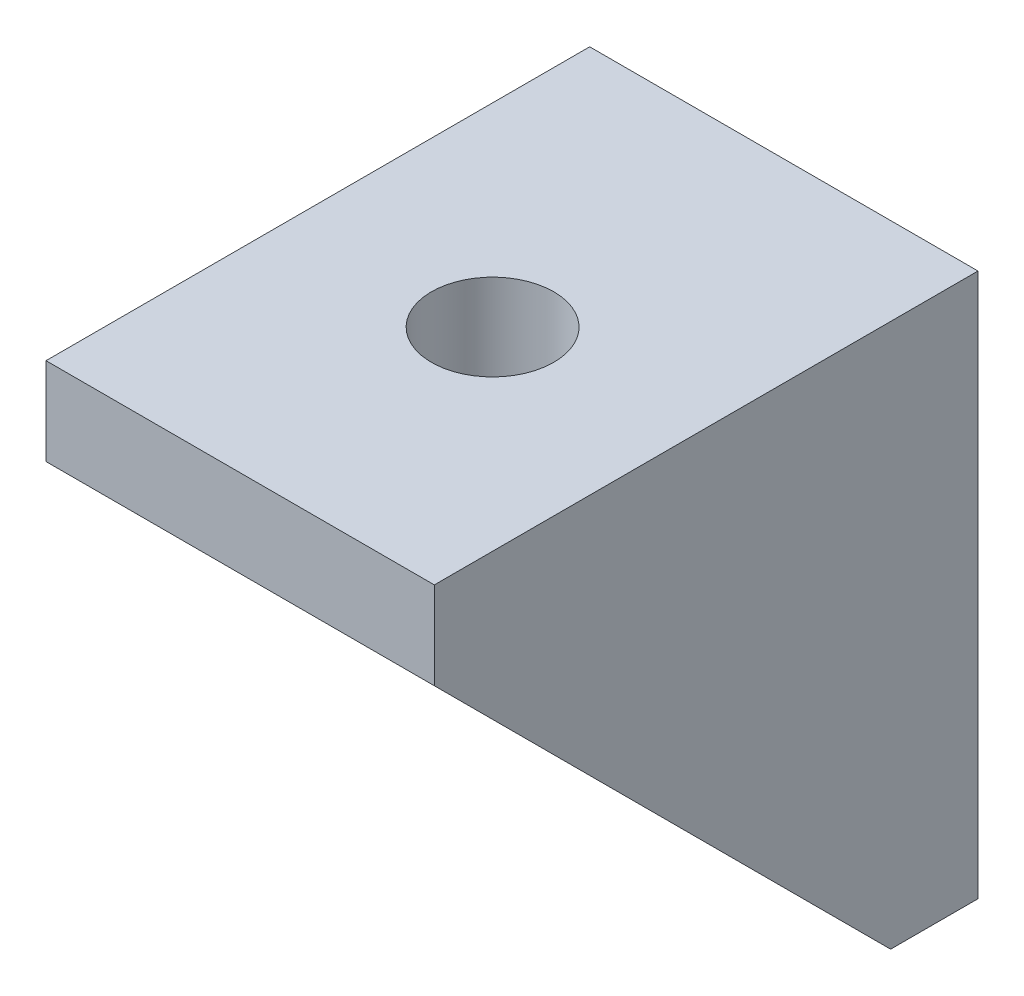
ISO-10303-21;
HEADER;
FILE_DESCRIPTION(('STEP AP214'),'2;1');
FILE_NAME('part.step','',(''),(''),'','','');
FILE_SCHEMA(('AUTOMOTIVE_DESIGN { 1 0 10303 214 1 1 1 1 }'));
ENDSEC;
DATA;
#1=APPLICATION_CONTEXT('core data for automotive mechanical design processes');
#2=APPLICATION_PROTOCOL_DEFINITION('international standard','automotive_design',2000,#1);
#3=PRODUCT_CONTEXT('',#1,'mechanical');
#4=PRODUCT('Part','Part','',(#3));
#5=PRODUCT_RELATED_PRODUCT_CATEGORY('part','',(#4));
#6=PRODUCT_DEFINITION_FORMATION('','',#4);
#7=PRODUCT_DEFINITION_CONTEXT('part definition',#1,'design');
#8=PRODUCT_DEFINITION('design','',#6,#7);
#9=PRODUCT_DEFINITION_SHAPE('','',#8);
#10=(LENGTH_UNIT() NAMED_UNIT(*) SI_UNIT(.MILLI.,.METRE.));
#11=(NAMED_UNIT(*) PLANE_ANGLE_UNIT() SI_UNIT($,.RADIAN.));
#12=(NAMED_UNIT(*) SI_UNIT($,.STERADIAN.) SOLID_ANGLE_UNIT());
#13=UNCERTAINTY_MEASURE_WITH_UNIT(LENGTH_MEASURE(1.E-05),#10,'distance_accuracy_value','');
#14=(GEOMETRIC_REPRESENTATION_CONTEXT(3) GLOBAL_UNCERTAINTY_ASSIGNED_CONTEXT((#13)) GLOBAL_UNIT_ASSIGNED_CONTEXT((#10,
#11,#12)) REPRESENTATION_CONTEXT('',''));
#15=CARTESIAN_POINT('',(0.,0.,0.));
#16=DIRECTION('',(0.,0.,1.));
#17=DIRECTION('',(1.,0.,0.));
#18=AXIS2_PLACEMENT_3D('',#15,#16,#17);
#19=CARTESIAN_POINT('',(8.,-18.5,18.5));
#20=DIRECTION('',(-1.,0.,0.));
#21=DIRECTION('',(0.,0.,1.));
#22=AXIS2_PLACEMENT_3D('',#19,#20,#21);
#23=PLANE('',#22);
#24=DIRECTION('',(0.,0.,-1.));
#25=VECTOR('',#24,1.);
#26=CARTESIAN_POINT('',(8.,-4.5,18.5));
#27=LINE('',#26,#25);
#28=CARTESIAN_POINT('',(8.,-4.5,4.5));
#29=VERTEX_POINT('',#28);
#30=CARTESIAN_POINT('',(8.,-4.5,28.));
#31=VERTEX_POINT('',#30);
#32=EDGE_CURVE('E105',#29,#31,#27,.F.);
#33=ORIENTED_EDGE('',*,*,#32,.F.);
#34=DIRECTION('',(0.,1.,0.));
#35=VECTOR('',#34,1.);
#36=CARTESIAN_POINT('',(8.,-18.5,4.5));
#37=LINE('',#36,#35);
#38=CARTESIAN_POINT('',(8.,-28.,4.5));
#39=VERTEX_POINT('',#38);
#40=EDGE_CURVE('E78',#29,#39,#37,.F.);
#41=ORIENTED_EDGE('',*,*,#40,.T.);
#42=DIRECTION('',(0.,-0.707106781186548,-0.707106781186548));
#43=VECTOR('',#42,1.);
#44=CARTESIAN_POINT('',(8.,-8.20101012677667,24.2989898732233));
#45=LINE('',#44,#43);
#46=EDGE_CURVE('E101',#31,#39,#45,.T.);
#47=ORIENTED_EDGE('',*,*,#46,.F.);
#48=EDGE_LOOP('',(#33,#41,#47));
#49=FACE_BOUND('',#48,.T.);
#50=ADVANCED_FACE('F15',(#49),#23,.T.);
#51=CARTESIAN_POINT('',(0.,-18.5,4.5));
#52=DIRECTION('',(0.,0.,-1.));
#53=DIRECTION('',(-1.,0.,0.));
#54=AXIS2_PLACEMENT_3D('',#51,#52,#53);
#55=PLANE('',#54);
#56=ORIENTED_EDGE('',*,*,#40,.F.);
#57=DIRECTION('',(1.,0.,0.));
#58=VECTOR('',#57,1.);
#59=CARTESIAN_POINT('',(0.,-4.5,4.5));
#60=LINE('',#59,#58);
#61=CARTESIAN_POINT('',(-8.,-4.5,4.5));
#62=VERTEX_POINT('',#61);
#63=EDGE_CURVE('E97',#62,#29,#60,.T.);
#64=ORIENTED_EDGE('',*,*,#63,.F.);
#65=DIRECTION('',(0.,1.,0.));
#66=VECTOR('',#65,1.);
#67=CARTESIAN_POINT('',(-8.,-18.5,4.5));
#68=LINE('',#67,#66);
#69=CARTESIAN_POINT('',(-8.,-28.,4.5));
#70=VERTEX_POINT('',#69);
#71=EDGE_CURVE('E85',#70,#62,#68,.T.);
#72=ORIENTED_EDGE('',*,*,#71,.F.);
#73=DIRECTION('',(1.,0.,0.));
#74=VECTOR('',#73,1.);
#75=CARTESIAN_POINT('',(0.,-28.,4.5));
#76=LINE('',#75,#74);
#77=EDGE_CURVE('E107',#70,#39,#76,.T.);
#78=ORIENTED_EDGE('',*,*,#77,.T.);
#79=EDGE_LOOP('',(#56,#64,#72,#78));
#80=FACE_BOUND('',#79,.T.);
#81=CARTESIAN_POINT('',(0.,-15.,4.5));
#82=DIRECTION('',(0.,0.,1.));
#83=DIRECTION('',(1.,0.,0.));
#84=AXIS2_PLACEMENT_3D('',#81,#82,#83);
#85=CIRCLE('',#84,3.15);
#86=CARTESIAN_POINT('',(3.15,-15.,4.5));
#87=VERTEX_POINT('',#86);
#88=EDGE_CURVE('E18',#87,#87,#85,.F.);
#89=ORIENTED_EDGE('',*,*,#88,.T.);
#90=EDGE_LOOP('',(#89));
#91=FACE_BOUND('',#90,.T.);
#92=ADVANCED_FACE('F103',(#80,#91),#55,.F.);
#93=CARTESIAN_POINT('',(-8.,-18.5,18.5));
#94=DIRECTION('',(1.,0.,0.));
#95=DIRECTION('',(0.,0.,-1.));
#96=AXIS2_PLACEMENT_3D('',#93,#94,#95);
#97=PLANE('',#96);
#98=ORIENTED_EDGE('',*,*,#71,.T.);
#99=DIRECTION('',(0.,0.,-1.));
#100=VECTOR('',#99,1.);
#101=CARTESIAN_POINT('',(-8.,-4.5,18.5));
#102=LINE('',#101,#100);
#103=CARTESIAN_POINT('',(-8.,-4.5,28.));
#104=VERTEX_POINT('',#103);
#105=EDGE_CURVE('E88',#104,#62,#102,.T.);
#106=ORIENTED_EDGE('',*,*,#105,.F.);
#107=DIRECTION('',(0.,-0.707106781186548,-0.707106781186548));
#108=VECTOR('',#107,1.);
#109=CARTESIAN_POINT('',(-8.,-8.20101012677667,24.2989898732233));
#110=LINE('',#109,#108);
#111=EDGE_CURVE('E90',#70,#104,#110,.F.);
#112=ORIENTED_EDGE('',*,*,#111,.F.);
#113=EDGE_LOOP('',(#98,#106,#112));
#114=FACE_BOUND('',#113,.T.);
#115=ADVANCED_FACE('F87',(#114),#97,.T.);
#116=CARTESIAN_POINT('',(0.,-15.,2.25));
#117=DIRECTION('',(0.,0.,1.));
#118=DIRECTION('',(1.,0.,0.));
#119=AXIS2_PLACEMENT_3D('',#116,#117,#118);
#120=CYLINDRICAL_SURFACE('',#119,3.15);
#121=CARTESIAN_POINT('',(0.,-15.,0.));
#122=DIRECTION('',(0.,0.,1.));
#123=DIRECTION('',(1.,0.,0.));
#124=AXIS2_PLACEMENT_3D('',#121,#122,#123);
#125=CIRCLE('',#124,3.15);
#126=CARTESIAN_POINT('',(3.15,-15.,0.));
#127=VERTEX_POINT('',#126);
#128=EDGE_CURVE('E118',#127,#127,#125,.T.);
#129=ORIENTED_EDGE('',*,*,#128,.F.);
#130=EDGE_LOOP('',(#129));
#131=FACE_BOUND('',#130,.T.);
#132=ORIENTED_EDGE('',*,*,#88,.F.);
#133=EDGE_LOOP('',(#132));
#134=FACE_BOUND('',#133,.T.);
#135=ADVANCED_FACE('F212',(#131,#134),#120,.F.);
#136=CARTESIAN_POINT('',(0.,-8.20101012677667,24.2989898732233));
#137=DIRECTION('',(0.,-0.707106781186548,0.707106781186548));
#138=DIRECTION('',(0.,-0.707106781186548,-0.707106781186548));
#139=AXIS2_PLACEMENT_3D('',#136,#137,#138);
#140=PLANE('',#139);
#141=DIRECTION('',(0.,0.707106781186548,0.707106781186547));
#142=VECTOR('',#141,1.);
#143=CARTESIAN_POINT('',(10.,-28.,4.5));
#144=LINE('',#143,#142);
#145=CARTESIAN_POINT('',(10.,-28.,4.5));
#146=VERTEX_POINT('',#145);
#147=CARTESIAN_POINT('',(10.,-4.49999999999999,28.));
#148=VERTEX_POINT('',#147);
#149=EDGE_CURVE('E145',#146,#148,#144,.T.);
#150=ORIENTED_EDGE('',*,*,#149,.T.);
#151=DIRECTION('',(-1.,0.,0.));
#152=VECTOR('',#151,1.);
#153=CARTESIAN_POINT('',(0.,-4.49999999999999,28.));
#154=LINE('',#153,#152);
#155=EDGE_CURVE('E155',#148,#31,#154,.T.);
#156=ORIENTED_EDGE('',*,*,#155,.T.);
#157=ORIENTED_EDGE('',*,*,#46,.T.);
#158=DIRECTION('',(1.,0.,0.));
#159=VECTOR('',#158,1.);
#160=CARTESIAN_POINT('',(0.,-28.,4.5));
#161=LINE('',#160,#159);
#162=EDGE_CURVE('E129',#39,#146,#161,.T.);
#163=ORIENTED_EDGE('',*,*,#162,.T.);
#164=EDGE_LOOP('',(#150,#156,#157,#163));
#165=FACE_BOUND('',#164,.T.);
#166=ADVANCED_FACE('F143',(#165),#140,.T.);
#167=CARTESIAN_POINT('',(0.,-4.5,18.5));
#168=DIRECTION('',(0.,-1.,0.));
#169=DIRECTION('',(0.,0.,-1.));
#170=AXIS2_PLACEMENT_3D('',#167,#168,#169);
#171=PLANE('',#170);
#172=ORIENTED_EDGE('',*,*,#63,.T.);
#173=ORIENTED_EDGE('',*,*,#32,.T.);
#174=DIRECTION('',(-1.,0.,0.));
#175=VECTOR('',#174,1.);
#176=CARTESIAN_POINT('',(0.,-4.5,28.));
#177=LINE('',#176,#175);
#178=EDGE_CURVE('E100',#31,#104,#177,.T.);
#179=ORIENTED_EDGE('',*,*,#178,.T.);
#180=ORIENTED_EDGE('',*,*,#105,.T.);
#181=EDGE_LOOP('',(#172,#173,#179,#180));
#182=FACE_BOUND('',#181,.T.);
#183=CARTESIAN_POINT('',(0.,-4.5,15.));
#184=DIRECTION('',(0.,-1.,0.));
#185=DIRECTION('',(0.,0.,-1.));
#186=AXIS2_PLACEMENT_3D('',#183,#184,#185);
#187=CIRCLE('',#186,3.15);
#188=CARTESIAN_POINT('',(0.,-4.5,11.85));
#189=VERTEX_POINT('',#188);
#190=EDGE_CURVE('E121',#189,#189,#187,.F.);
#191=ORIENTED_EDGE('',*,*,#190,.T.);
#192=EDGE_LOOP('',(#191));
#193=FACE_BOUND('',#192,.T.);
#194=ADVANCED_FACE('F95',(#182,#193),#171,.T.);
#195=CARTESIAN_POINT('',(0.,-28.,14.));
#196=DIRECTION('',(0.,1.,0.));
#197=DIRECTION('',(0.,0.,1.));
#198=AXIS2_PLACEMENT_3D('',#195,#196,#197);
#199=PLANE('',#198);
#200=ORIENTED_EDGE('',*,*,#77,.F.);
#201=DIRECTION('',(1.,0.,0.));
#202=VECTOR('',#201,1.);
#203=CARTESIAN_POINT('',(0.,-28.,4.49999999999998));
#204=LINE('',#203,#202);
#205=CARTESIAN_POINT('',(-10.,-28.,4.5));
#206=VERTEX_POINT('',#205);
#207=EDGE_CURVE('E123',#206,#70,#204,.T.);
#208=ORIENTED_EDGE('',*,*,#207,.F.);
#209=DIRECTION('',(0.,0.,-1.));
#210=VECTOR('',#209,1.);
#211=CARTESIAN_POINT('',(-10.,-28.,14.));
#212=LINE('',#211,#210);
#213=CARTESIAN_POINT('',(-10.,-28.,0.));
#214=VERTEX_POINT('',#213);
#215=EDGE_CURVE('E168',#206,#214,#212,.T.);
#216=ORIENTED_EDGE('',*,*,#215,.T.);
#217=DIRECTION('',(-1.,0.,0.));
#218=VECTOR('',#217,1.);
#219=CARTESIAN_POINT('',(0.,-28.,0.));
#220=LINE('',#219,#218);
#221=CARTESIAN_POINT('',(10.,-28.,0.));
#222=VERTEX_POINT('',#221);
#223=EDGE_CURVE('E120',#222,#214,#220,.T.);
#224=ORIENTED_EDGE('',*,*,#223,.F.);
#225=DIRECTION('',(0.,0.,1.));
#226=VECTOR('',#225,1.);
#227=CARTESIAN_POINT('',(10.,-28.,14.));
#228=LINE('',#227,#226);
#229=EDGE_CURVE('E140',#222,#146,#228,.T.);
#230=ORIENTED_EDGE('',*,*,#229,.T.);
#231=ORIENTED_EDGE('',*,*,#162,.F.);
#232=EDGE_LOOP('',(#200,#208,#216,#224,#230,#231));
#233=FACE_BOUND('',#232,.T.);
#234=ADVANCED_FACE('F136',(#233),#199,.F.);
#235=CARTESIAN_POINT('',(0.,-8.20101012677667,24.2989898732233));
#236=DIRECTION('',(0.,-0.707106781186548,0.707106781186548));
#237=DIRECTION('',(0.,-0.707106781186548,-0.707106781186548));
#238=AXIS2_PLACEMENT_3D('',#235,#236,#237);
#239=PLANE('',#238);
#240=DIRECTION('',(0.,-0.707106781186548,-0.707106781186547));
#241=VECTOR('',#240,1.);
#242=CARTESIAN_POINT('',(-10.,-4.49999999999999,28.));
#243=LINE('',#242,#241);
#244=CARTESIAN_POINT('',(-10.,-4.49999999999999,28.));
#245=VERTEX_POINT('',#244);
#246=EDGE_CURVE('E117',#245,#206,#243,.T.);
#247=ORIENTED_EDGE('',*,*,#246,.T.);
#248=ORIENTED_EDGE('',*,*,#207,.T.);
#249=ORIENTED_EDGE('',*,*,#111,.T.);
#250=DIRECTION('',(-1.,0.,0.));
#251=VECTOR('',#250,1.);
#252=CARTESIAN_POINT('',(0.,-4.5,28.));
#253=LINE('',#252,#251);
#254=EDGE_CURVE('E170',#104,#245,#253,.T.);
#255=ORIENTED_EDGE('',*,*,#254,.T.);
#256=EDGE_LOOP('',(#247,#248,#249,#255));
#257=FACE_BOUND('',#256,.T.);
#258=ADVANCED_FACE('F179',(#257),#239,.T.);
#259=CARTESIAN_POINT('',(0.,-2.25,15.));
#260=DIRECTION('',(0.,-1.,0.));
#261=DIRECTION('',(0.,0.,-1.));
#262=AXIS2_PLACEMENT_3D('',#259,#260,#261);
#263=CYLINDRICAL_SURFACE('',#262,3.15);
#264=ORIENTED_EDGE('',*,*,#190,.F.);
#265=EDGE_LOOP('',(#264));
#266=FACE_BOUND('',#265,.T.);
#267=CARTESIAN_POINT('',(0.,0.,15.));
#268=DIRECTION('',(0.,-1.,0.));
#269=DIRECTION('',(0.,0.,-1.));
#270=AXIS2_PLACEMENT_3D('',#267,#268,#269);
#271=CIRCLE('',#270,3.15);
#272=CARTESIAN_POINT('',(0.,0.,11.85));
#273=VERTEX_POINT('',#272);
#274=EDGE_CURVE('E113',#273,#273,#271,.F.);
#275=ORIENTED_EDGE('',*,*,#274,.T.);
#276=EDGE_LOOP('',(#275));
#277=FACE_BOUND('',#276,.T.);
#278=ADVANCED_FACE('F193',(#266,#277),#263,.F.);
#279=CARTESIAN_POINT('',(0.,-14.,0.));
#280=DIRECTION('',(0.,0.,-1.));
#281=DIRECTION('',(-1.,0.,0.));
#282=AXIS2_PLACEMENT_3D('',#279,#280,#281);
#283=PLANE('',#282);
#284=DIRECTION('',(1.,0.,0.));
#285=VECTOR('',#284,1.);
#286=CARTESIAN_POINT('',(0.,0.,0.));
#287=LINE('',#286,#285);
#288=CARTESIAN_POINT('',(-10.,0.,0.));
#289=VERTEX_POINT('',#288);
#290=CARTESIAN_POINT('',(10.,0.,0.));
#291=VERTEX_POINT('',#290);
#292=EDGE_CURVE('E116',#289,#291,#287,.T.);
#293=ORIENTED_EDGE('',*,*,#292,.T.);
#294=DIRECTION('',(0.,1.,0.));
#295=VECTOR('',#294,1.);
#296=CARTESIAN_POINT('',(10.,-14.,0.));
#297=LINE('',#296,#295);
#298=EDGE_CURVE('E157',#291,#222,#297,.F.);
#299=ORIENTED_EDGE('',*,*,#298,.T.);
#300=ORIENTED_EDGE('',*,*,#223,.T.);
#301=DIRECTION('',(0.,1.,0.));
#302=VECTOR('',#301,1.);
#303=CARTESIAN_POINT('',(-10.,-14.,0.));
#304=LINE('',#303,#302);
#305=EDGE_CURVE('E166',#214,#289,#304,.T.);
#306=ORIENTED_EDGE('',*,*,#305,.T.);
#307=EDGE_LOOP('',(#293,#299,#300,#306));
#308=FACE_BOUND('',#307,.T.);
#309=ORIENTED_EDGE('',*,*,#128,.T.);
#310=EDGE_LOOP('',(#309));
#311=FACE_BOUND('',#310,.T.);
#312=ADVANCED_FACE('F164',(#308,#311),#283,.T.);
#313=CARTESIAN_POINT('',(10.,-14.,14.));
#314=DIRECTION('',(-1.,0.,0.));
#315=DIRECTION('',(0.,0.,1.));
#316=AXIS2_PLACEMENT_3D('',#313,#314,#315);
#317=PLANE('',#316);
#318=ORIENTED_EDGE('',*,*,#229,.F.);
#319=ORIENTED_EDGE('',*,*,#298,.F.);
#320=DIRECTION('',(0.,0.,-1.));
#321=VECTOR('',#320,1.);
#322=CARTESIAN_POINT('',(10.,0.,14.));
#323=LINE('',#322,#321);
#324=CARTESIAN_POINT('',(10.,0.,28.));
#325=VERTEX_POINT('',#324);
#326=EDGE_CURVE('E183',#291,#325,#323,.F.);
#327=ORIENTED_EDGE('',*,*,#326,.T.);
#328=DIRECTION('',(0.,1.,0.));
#329=VECTOR('',#328,1.);
#330=CARTESIAN_POINT('',(10.,-14.,28.));
#331=LINE('',#330,#329);
#332=EDGE_CURVE('E153',#325,#148,#331,.F.);
#333=ORIENTED_EDGE('',*,*,#332,.T.);
#334=ORIENTED_EDGE('',*,*,#149,.F.);
#335=EDGE_LOOP('',(#318,#319,#327,#333,#334));
#336=FACE_BOUND('',#335,.T.);
#337=ADVANCED_FACE('F150',(#336),#317,.F.);
#338=CARTESIAN_POINT('',(0.,-14.,28.));
#339=DIRECTION('',(0.,0.,-1.));
#340=DIRECTION('',(-1.,0.,0.));
#341=AXIS2_PLACEMENT_3D('',#338,#339,#340);
#342=PLANE('',#341);
#343=ORIENTED_EDGE('',*,*,#178,.F.);
#344=ORIENTED_EDGE('',*,*,#155,.F.);
#345=ORIENTED_EDGE('',*,*,#332,.F.);
#346=DIRECTION('',(1.,0.,0.));
#347=VECTOR('',#346,1.);
#348=CARTESIAN_POINT('',(0.,0.,28.));
#349=LINE('',#348,#347);
#350=CARTESIAN_POINT('',(-10.,0.,28.));
#351=VERTEX_POINT('',#350);
#352=EDGE_CURVE('E24',#325,#351,#349,.F.);
#353=ORIENTED_EDGE('',*,*,#352,.T.);
#354=DIRECTION('',(0.,1.,0.));
#355=VECTOR('',#354,1.);
#356=CARTESIAN_POINT('',(-10.,-14.,28.));
#357=LINE('',#356,#355);
#358=EDGE_CURVE('E32',#351,#245,#357,.F.);
#359=ORIENTED_EDGE('',*,*,#358,.T.);
#360=ORIENTED_EDGE('',*,*,#254,.F.);
#361=EDGE_LOOP('',(#343,#344,#345,#353,#359,#360));
#362=FACE_BOUND('',#361,.T.);
#363=ADVANCED_FACE('F176',(#362),#342,.F.);
#364=CARTESIAN_POINT('',(-10.,-14.,14.));
#365=DIRECTION('',(1.,0.,0.));
#366=DIRECTION('',(0.,0.,-1.));
#367=AXIS2_PLACEMENT_3D('',#364,#365,#366);
#368=PLANE('',#367);
#369=ORIENTED_EDGE('',*,*,#358,.F.);
#370=DIRECTION('',(0.,0.,-1.));
#371=VECTOR('',#370,1.);
#372=CARTESIAN_POINT('',(-10.,0.,14.));
#373=LINE('',#372,#371);
#374=EDGE_CURVE('E10',#351,#289,#373,.T.);
#375=ORIENTED_EDGE('',*,*,#374,.T.);
#376=ORIENTED_EDGE('',*,*,#305,.F.);
#377=ORIENTED_EDGE('',*,*,#215,.F.);
#378=ORIENTED_EDGE('',*,*,#246,.F.);
#379=EDGE_LOOP('',(#369,#375,#376,#377,#378));
#380=FACE_BOUND('',#379,.T.);
#381=ADVANCED_FACE('F167',(#380),#368,.F.);
#382=CARTESIAN_POINT('',(0.,0.,14.));
#383=DIRECTION('',(0.,-1.,0.));
#384=DIRECTION('',(0.,0.,-1.));
#385=AXIS2_PLACEMENT_3D('',#382,#383,#384);
#386=PLANE('',#385);
#387=ORIENTED_EDGE('',*,*,#352,.F.);
#388=ORIENTED_EDGE('',*,*,#326,.F.);
#389=ORIENTED_EDGE('',*,*,#292,.F.);
#390=ORIENTED_EDGE('',*,*,#374,.F.);
#391=EDGE_LOOP('',(#387,#388,#389,#390));
#392=FACE_BOUND('',#391,.T.);
#393=ORIENTED_EDGE('',*,*,#274,.F.);
#394=EDGE_LOOP('',(#393));
#395=FACE_BOUND('',#394,.T.);
#396=ADVANCED_FACE('F187',(#392,#395),#386,.F.);
#397=CLOSED_SHELL('',(#50,#92,#115,#135,#166,#194,#234,#258,#278,#312,#337,#363,#381,#396));
#398=MANIFOLD_SOLID_BREP('B1',#397);
#399=ADVANCED_BREP_SHAPE_REPRESENTATION('',(#18,#398),#14);
#400=SHAPE_DEFINITION_REPRESENTATION(#9,#399);
ENDSEC;
END-ISO-10303-21;
